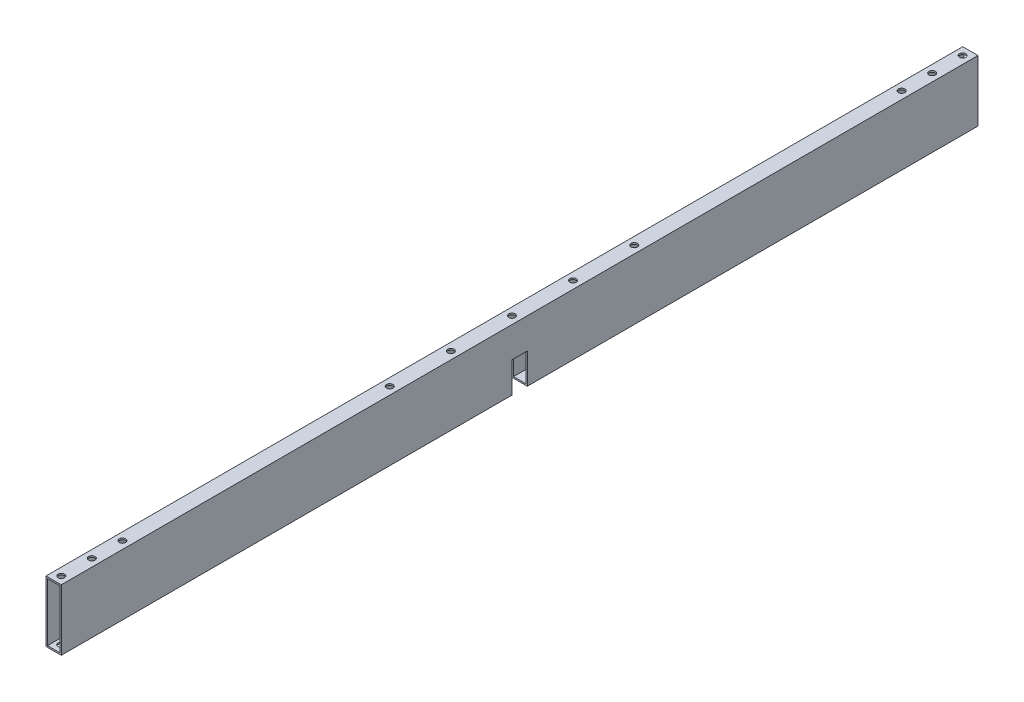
ISO-10303-21;
HEADER;
FILE_DESCRIPTION(('STEP AP214'),'2;1');
FILE_NAME('part.step','',(''),(''),'','','');
FILE_SCHEMA(('AUTOMOTIVE_DESIGN { 1 0 10303 214 1 1 1 1 }'));
ENDSEC;
DATA;
#1=APPLICATION_CONTEXT('core data for automotive mechanical design processes');
#2=APPLICATION_PROTOCOL_DEFINITION('international standard','automotive_design',2000,#1);
#3=PRODUCT_CONTEXT('',#1,'mechanical');
#4=PRODUCT('Part','Part','',(#3));
#5=PRODUCT_RELATED_PRODUCT_CATEGORY('part','',(#4));
#6=PRODUCT_DEFINITION_FORMATION('','',#4);
#7=PRODUCT_DEFINITION_CONTEXT('part definition',#1,'design');
#8=PRODUCT_DEFINITION('design','',#6,#7);
#9=PRODUCT_DEFINITION_SHAPE('','',#8);
#10=(LENGTH_UNIT() NAMED_UNIT(*) SI_UNIT(.MILLI.,.METRE.));
#11=(NAMED_UNIT(*) PLANE_ANGLE_UNIT() SI_UNIT($,.RADIAN.));
#12=(NAMED_UNIT(*) SI_UNIT($,.STERADIAN.) SOLID_ANGLE_UNIT());
#13=UNCERTAINTY_MEASURE_WITH_UNIT(LENGTH_MEASURE(1.E-05),#10,'distance_accuracy_value','');
#14=(GEOMETRIC_REPRESENTATION_CONTEXT(3) GLOBAL_UNCERTAINTY_ASSIGNED_CONTEXT((#13)) GLOBAL_UNIT_ASSIGNED_CONTEXT((#10,
#11,#12)) REPRESENTATION_CONTEXT('',''));
#15=CARTESIAN_POINT('',(0.,0.,0.));
#16=DIRECTION('',(0.,0.,1.));
#17=DIRECTION('',(1.,0.,0.));
#18=AXIS2_PLACEMENT_3D('',#15,#16,#17);
#19=CARTESIAN_POINT('',(-5.,-20.,300.));
#20=DIRECTION('',(0.,1.,0.));
#21=DIRECTION('',(0.,0.,1.));
#22=AXIS2_PLACEMENT_3D('',#19,#20,#21);
#23=PLANE('',#22);
#24=CARTESIAN_POINT('',(2.74086309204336E-13,-20.,80.));
#25=DIRECTION('',(0.,1.,0.));
#26=DIRECTION('',(0.,0.,1.));
#27=AXIS2_PLACEMENT_3D('',#24,#25,#26);
#28=CIRCLE('',#27,2.1);
#29=CARTESIAN_POINT('',(2.74086309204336E-13,-20.,82.1));
#30=VERTEX_POINT('',#29);
#31=EDGE_CURVE('E225',#30,#30,#28,.T.);
#32=ORIENTED_EDGE('',*,*,#31,.T.);
#33=EDGE_LOOP('',(#32));
#34=FACE_BOUND('',#33,.T.);
#35=CARTESIAN_POINT('',(1.37043154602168E-13,-20.,40.));
#36=DIRECTION('',(0.,1.,0.));
#37=DIRECTION('',(0.,0.,1.));
#38=AXIS2_PLACEMENT_3D('',#35,#36,#37);
#39=CIRCLE('',#38,2.1);
#40=CARTESIAN_POINT('',(1.37043154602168E-13,-20.,42.1));
#41=VERTEX_POINT('',#40);
#42=EDGE_CURVE('E758',#41,#41,#39,.T.);
#43=ORIENTED_EDGE('',*,*,#42,.T.);
#44=EDGE_LOOP('',(#43));
#45=FACE_BOUND('',#44,.T.);
#46=CARTESIAN_POINT('',(0.,-20.,295.));
#47=DIRECTION('',(0.,-1.,0.));
#48=DIRECTION('',(0.,0.,-1.));
#49=AXIS2_PLACEMENT_3D('',#46,#47,#48);
#50=CIRCLE('',#49,2.1);
#51=CARTESIAN_POINT('',(0.,-20.,292.9));
#52=VERTEX_POINT('',#51);
#53=EDGE_CURVE('E212',#52,#52,#50,.T.);
#54=ORIENTED_EDGE('',*,*,#53,.F.);
#55=EDGE_LOOP('',(#54));
#56=FACE_BOUND('',#55,.T.);
#57=CARTESIAN_POINT('',(2.0818924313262E-13,-20.,275.));
#58=DIRECTION('',(0.,-1.,0.));
#59=DIRECTION('',(0.,0.,-1.));
#60=AXIS2_PLACEMENT_3D('',#57,#58,#59);
#61=CIRCLE('',#60,2.1);
#62=CARTESIAN_POINT('',(2.0818924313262E-13,-20.,272.9));
#63=VERTEX_POINT('',#62);
#64=EDGE_CURVE('E254',#63,#63,#61,.T.);
#65=ORIENTED_EDGE('',*,*,#64,.F.);
#66=EDGE_LOOP('',(#65));
#67=FACE_BOUND('',#66,.T.);
#68=CARTESIAN_POINT('',(4.16453476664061E-13,-20.,255.));
#69=DIRECTION('',(0.,-1.,0.));
#70=DIRECTION('',(0.,0.,-1.));
#71=AXIS2_PLACEMENT_3D('',#68,#69,#70);
#72=CIRCLE('',#71,2.1);
#73=CARTESIAN_POINT('',(4.16453476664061E-13,-20.,252.9));
#74=VERTEX_POINT('',#73);
#75=EDGE_CURVE('E260',#74,#74,#72,.T.);
#76=ORIENTED_EDGE('',*,*,#75,.F.);
#77=EDGE_LOOP('',(#76));
#78=FACE_BOUND('',#77,.T.);
#79=DIRECTION('',(0.,0.,-1.));
#80=VECTOR('',#79,1.);
#81=CARTESIAN_POINT('',(-5.,-20.,300.));
#82=LINE('',#81,#80);
#83=CARTESIAN_POINT('',(-5.,-20.,300.));
#84=VERTEX_POINT('',#83);
#85=CARTESIAN_POINT('',(-5.,-20.,5.));
#86=VERTEX_POINT('',#85);
#87=EDGE_CURVE('E174',#84,#86,#82,.T.);
#88=ORIENTED_EDGE('',*,*,#87,.T.);
#89=DIRECTION('',(1.,0.,0.));
#90=VECTOR('',#89,1.);
#91=CARTESIAN_POINT('',(-5.,-20.,5.));
#92=LINE('',#91,#90);
#93=CARTESIAN_POINT('',(5.,-20.,5.));
#94=VERTEX_POINT('',#93);
#95=EDGE_CURVE('E155',#86,#94,#92,.T.);
#96=ORIENTED_EDGE('',*,*,#95,.T.);
#97=DIRECTION('',(0.,0.,-1.));
#98=VECTOR('',#97,1.);
#99=CARTESIAN_POINT('',(5.,-20.,300.));
#100=LINE('',#99,#98);
#101=CARTESIAN_POINT('',(5.,-20.,300.));
#102=VERTEX_POINT('',#101);
#103=EDGE_CURVE('E186',#102,#94,#100,.T.);
#104=ORIENTED_EDGE('',*,*,#103,.F.);
#105=DIRECTION('',(1.,0.,0.));
#106=VECTOR('',#105,1.);
#107=CARTESIAN_POINT('',(-5.,-20.,300.));
#108=LINE('',#107,#106);
#109=EDGE_CURVE('E179',#84,#102,#108,.T.);
#110=ORIENTED_EDGE('',*,*,#109,.F.);
#111=EDGE_LOOP('',(#88,#96,#104,#110));
#112=FACE_BOUND('',#111,.T.);
#113=ADVANCED_FACE('F41',(#34,#45,#56,#67,#78,#112),#23,.F.);
#114=CARTESIAN_POINT('',(-4.00000000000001,-19.,300.));
#115=DIRECTION('',(0.,1.,0.));
#116=DIRECTION('',(0.,0.,1.));
#117=AXIS2_PLACEMENT_3D('',#114,#115,#116);
#118=PLANE('',#117);
#119=CARTESIAN_POINT('',(2.74086309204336E-13,-19.,80.));
#120=DIRECTION('',(0.,1.,0.));
#121=DIRECTION('',(0.,0.,1.));
#122=AXIS2_PLACEMENT_3D('',#119,#120,#121);
#123=CIRCLE('',#122,2.1);
#124=CARTESIAN_POINT('',(2.74086309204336E-13,-19.,82.1));
#125=VERTEX_POINT('',#124);
#126=EDGE_CURVE('E242',#125,#125,#123,.T.);
#127=ORIENTED_EDGE('',*,*,#126,.F.);
#128=EDGE_LOOP('',(#127));
#129=FACE_BOUND('',#128,.T.);
#130=CARTESIAN_POINT('',(1.37043154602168E-13,-19.,40.));
#131=DIRECTION('',(0.,1.,0.));
#132=DIRECTION('',(0.,0.,1.));
#133=AXIS2_PLACEMENT_3D('',#130,#131,#132);
#134=CIRCLE('',#133,2.1);
#135=CARTESIAN_POINT('',(1.37043154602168E-13,-19.,42.1));
#136=VERTEX_POINT('',#135);
#137=EDGE_CURVE('E234',#136,#136,#134,.T.);
#138=ORIENTED_EDGE('',*,*,#137,.F.);
#139=EDGE_LOOP('',(#138));
#140=FACE_BOUND('',#139,.T.);
#141=CARTESIAN_POINT('',(0.,-19.,295.));
#142=DIRECTION('',(0.,1.,0.));
#143=DIRECTION('',(0.,0.,1.));
#144=AXIS2_PLACEMENT_3D('',#141,#142,#143);
#145=CIRCLE('',#144,2.1);
#146=CARTESIAN_POINT('',(0.,-19.,297.1));
#147=VERTEX_POINT('',#146);
#148=EDGE_CURVE('E220',#147,#147,#145,.F.);
#149=ORIENTED_EDGE('',*,*,#148,.T.);
#150=EDGE_LOOP('',(#149));
#151=FACE_BOUND('',#150,.T.);
#152=CARTESIAN_POINT('',(2.0818924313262E-13,-19.,275.));
#153=DIRECTION('',(0.,1.,0.));
#154=DIRECTION('',(0.,0.,1.));
#155=AXIS2_PLACEMENT_3D('',#152,#153,#154);
#156=CIRCLE('',#155,2.1);
#157=CARTESIAN_POINT('',(2.0818924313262E-13,-19.,277.1));
#158=VERTEX_POINT('',#157);
#159=EDGE_CURVE('E216',#158,#158,#156,.F.);
#160=ORIENTED_EDGE('',*,*,#159,.T.);
#161=EDGE_LOOP('',(#160));
#162=FACE_BOUND('',#161,.T.);
#163=CARTESIAN_POINT('',(4.16453476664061E-13,-19.,255.));
#164=DIRECTION('',(0.,1.,0.));
#165=DIRECTION('',(0.,0.,1.));
#166=AXIS2_PLACEMENT_3D('',#163,#164,#165);
#167=CIRCLE('',#166,2.1);
#168=CARTESIAN_POINT('',(4.16453476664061E-13,-19.,257.1));
#169=VERTEX_POINT('',#168);
#170=EDGE_CURVE('E211',#169,#169,#167,.F.);
#171=ORIENTED_EDGE('',*,*,#170,.T.);
#172=EDGE_LOOP('',(#171));
#173=FACE_BOUND('',#172,.T.);
#174=DIRECTION('',(1.,0.,0.));
#175=VECTOR('',#174,1.);
#176=CARTESIAN_POINT('',(-4.00000000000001,-19.,5.));
#177=LINE('',#176,#175);
#178=CARTESIAN_POINT('',(-4.00000000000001,-19.,5.));
#179=VERTEX_POINT('',#178);
#180=CARTESIAN_POINT('',(4.,-19.,5.));
#181=VERTEX_POINT('',#180);
#182=EDGE_CURVE('E50',#179,#181,#177,.T.);
#183=ORIENTED_EDGE('',*,*,#182,.F.);
#184=DIRECTION('',(0.,0.,-1.));
#185=VECTOR('',#184,1.);
#186=CARTESIAN_POINT('',(-4.00000000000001,-19.,300.));
#187=LINE('',#186,#185);
#188=CARTESIAN_POINT('',(-4.00000000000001,-19.,300.));
#189=VERTEX_POINT('',#188);
#190=EDGE_CURVE('E345',#189,#179,#187,.T.);
#191=ORIENTED_EDGE('',*,*,#190,.F.);
#192=DIRECTION('',(1.,0.,0.));
#193=VECTOR('',#192,1.);
#194=CARTESIAN_POINT('',(-4.00000000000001,-19.,300.));
#195=LINE('',#194,#193);
#196=CARTESIAN_POINT('',(4.,-19.,300.));
#197=VERTEX_POINT('',#196);
#198=EDGE_CURVE('E328',#189,#197,#195,.T.);
#199=ORIENTED_EDGE('',*,*,#198,.T.);
#200=DIRECTION('',(0.,0.,-1.));
#201=VECTOR('',#200,1.);
#202=CARTESIAN_POINT('',(4.,-19.,300.));
#203=LINE('',#202,#201);
#204=EDGE_CURVE('E341',#197,#181,#203,.T.);
#205=ORIENTED_EDGE('',*,*,#204,.T.);
#206=EDGE_LOOP('',(#183,#191,#199,#205));
#207=FACE_BOUND('',#206,.T.);
#208=ADVANCED_FACE('F404',(#129,#140,#151,#162,#173,#207),#118,.T.);
#209=CARTESIAN_POINT('',(0.,0.,300.));
#210=DIRECTION('',(0.,0.,-1.));
#211=DIRECTION('',(-1.,0.,0.));
#212=AXIS2_PLACEMENT_3D('',#209,#210,#211);
#213=PLANE('',#212);
#214=DIRECTION('',(0.,1.,0.));
#215=VECTOR('',#214,1.);
#216=CARTESIAN_POINT('',(5.,-20.,300.));
#217=LINE('',#216,#215);
#218=CARTESIAN_POINT('',(5.,20.,300.));
#219=VERTEX_POINT('',#218);
#220=EDGE_CURVE('E354',#102,#219,#217,.T.);
#221=ORIENTED_EDGE('',*,*,#220,.T.);
#222=DIRECTION('',(-1.,0.,0.));
#223=VECTOR('',#222,1.);
#224=CARTESIAN_POINT('',(-5.,20.,300.));
#225=LINE('',#224,#223);
#226=CARTESIAN_POINT('',(-5.,20.,300.));
#227=VERTEX_POINT('',#226);
#228=EDGE_CURVE('E357',#219,#227,#225,.T.);
#229=ORIENTED_EDGE('',*,*,#228,.T.);
#230=DIRECTION('',(0.,-1.,0.));
#231=VECTOR('',#230,1.);
#232=CARTESIAN_POINT('',(-5.,-20.,300.));
#233=LINE('',#232,#231);
#234=EDGE_CURVE('E360',#227,#84,#233,.T.);
#235=ORIENTED_EDGE('',*,*,#234,.T.);
#236=ORIENTED_EDGE('',*,*,#109,.T.);
#237=EDGE_LOOP('',(#221,#229,#235,#236));
#238=FACE_BOUND('',#237,.T.);
#239=DIRECTION('',(0.,1.,0.));
#240=VECTOR('',#239,1.);
#241=CARTESIAN_POINT('',(4.,-19.,300.));
#242=LINE('',#241,#240);
#243=CARTESIAN_POINT('',(4.,19.,300.));
#244=VERTEX_POINT('',#243);
#245=EDGE_CURVE('E320',#197,#244,#242,.T.);
#246=ORIENTED_EDGE('',*,*,#245,.F.);
#247=ORIENTED_EDGE('',*,*,#198,.F.);
#248=DIRECTION('',(0.,-1.,0.));
#249=VECTOR('',#248,1.);
#250=CARTESIAN_POINT('',(-4.00000000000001,-19.,300.));
#251=LINE('',#250,#249);
#252=CARTESIAN_POINT('',(-4.00000000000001,19.,300.));
#253=VERTEX_POINT('',#252);
#254=EDGE_CURVE('E325',#253,#189,#251,.T.);
#255=ORIENTED_EDGE('',*,*,#254,.F.);
#256=DIRECTION('',(-1.,0.,0.));
#257=VECTOR('',#256,1.);
#258=CARTESIAN_POINT('',(-4.00000000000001,19.,300.));
#259=LINE('',#258,#257);
#260=EDGE_CURVE('E322',#244,#253,#259,.T.);
#261=ORIENTED_EDGE('',*,*,#260,.F.);
#262=EDGE_LOOP('',(#246,#247,#255,#261));
#263=FACE_BOUND('',#262,.T.);
#264=ADVANCED_FACE('F387',(#238,#263),#213,.F.);
#265=CARTESIAN_POINT('',(0.,0.,-300.));
#266=DIRECTION('',(0.,0.,-1.));
#267=DIRECTION('',(-1.,0.,0.));
#268=AXIS2_PLACEMENT_3D('',#265,#266,#267);
#269=PLANE('',#268);
#270=DIRECTION('',(0.,1.,0.));
#271=VECTOR('',#270,1.);
#272=CARTESIAN_POINT('',(5.,-20.,-300.));
#273=LINE('',#272,#271);
#274=CARTESIAN_POINT('',(5.,-20.,-300.));
#275=VERTEX_POINT('',#274);
#276=CARTESIAN_POINT('',(5.,20.,-300.));
#277=VERTEX_POINT('',#276);
#278=EDGE_CURVE('E353',#275,#277,#273,.T.);
#279=ORIENTED_EDGE('',*,*,#278,.F.);
#280=DIRECTION('',(1.,0.,0.));
#281=VECTOR('',#280,1.);
#282=CARTESIAN_POINT('',(-5.,-20.,-300.));
#283=LINE('',#282,#281);
#284=CARTESIAN_POINT('',(-5.,-20.,-300.));
#285=VERTEX_POINT('',#284);
#286=EDGE_CURVE('E358',#285,#275,#283,.T.);
#287=ORIENTED_EDGE('',*,*,#286,.F.);
#288=DIRECTION('',(0.,-1.,0.));
#289=VECTOR('',#288,1.);
#290=CARTESIAN_POINT('',(-5.,-20.,-300.));
#291=LINE('',#290,#289);
#292=CARTESIAN_POINT('',(-5.,20.,-300.));
#293=VERTEX_POINT('',#292);
#294=EDGE_CURVE('E368',#293,#285,#291,.T.);
#295=ORIENTED_EDGE('',*,*,#294,.F.);
#296=DIRECTION('',(-1.,0.,0.));
#297=VECTOR('',#296,1.);
#298=CARTESIAN_POINT('',(-5.,20.,-300.));
#299=LINE('',#298,#297);
#300=EDGE_CURVE('E366',#277,#293,#299,.T.);
#301=ORIENTED_EDGE('',*,*,#300,.F.);
#302=EDGE_LOOP('',(#279,#287,#295,#301));
#303=FACE_BOUND('',#302,.T.);
#304=DIRECTION('',(1.,0.,0.));
#305=VECTOR('',#304,1.);
#306=CARTESIAN_POINT('',(-4.00000000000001,-19.,-300.));
#307=LINE('',#306,#305);
#308=CARTESIAN_POINT('',(-4.00000000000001,-19.,-300.));
#309=VERTEX_POINT('',#308);
#310=CARTESIAN_POINT('',(4.,-19.,-300.));
#311=VERTEX_POINT('',#310);
#312=EDGE_CURVE('E323',#309,#311,#307,.T.);
#313=ORIENTED_EDGE('',*,*,#312,.T.);
#314=DIRECTION('',(0.,1.,0.));
#315=VECTOR('',#314,1.);
#316=CARTESIAN_POINT('',(4.,-19.,-300.));
#317=LINE('',#316,#315);
#318=CARTESIAN_POINT('',(4.,19.,-300.));
#319=VERTEX_POINT('',#318);
#320=EDGE_CURVE('E319',#311,#319,#317,.T.);
#321=ORIENTED_EDGE('',*,*,#320,.T.);
#322=DIRECTION('',(-1.,0.,0.));
#323=VECTOR('',#322,1.);
#324=CARTESIAN_POINT('',(-4.00000000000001,19.,-300.));
#325=LINE('',#324,#323);
#326=CARTESIAN_POINT('',(-4.00000000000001,19.,-300.));
#327=VERTEX_POINT('',#326);
#328=EDGE_CURVE('E333',#319,#327,#325,.T.);
#329=ORIENTED_EDGE('',*,*,#328,.T.);
#330=DIRECTION('',(0.,-1.,0.));
#331=VECTOR('',#330,1.);
#332=CARTESIAN_POINT('',(-4.00000000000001,-19.,-300.));
#333=LINE('',#332,#331);
#334=EDGE_CURVE('E336',#327,#309,#333,.T.);
#335=ORIENTED_EDGE('',*,*,#334,.T.);
#336=EDGE_LOOP('',(#313,#321,#329,#335));
#337=FACE_BOUND('',#336,.T.);
#338=ADVANCED_FACE('F379',(#303,#337),#269,.T.);
#339=CARTESIAN_POINT('',(5.,-20.,300.));
#340=DIRECTION('',(-1.,0.,0.));
#341=DIRECTION('',(0.,0.,1.));
#342=AXIS2_PLACEMENT_3D('',#339,#340,#341);
#343=PLANE('',#342);
#344=ORIENTED_EDGE('',*,*,#103,.T.);
#345=DIRECTION('',(0.,-1.,0.));
#346=VECTOR('',#345,1.);
#347=CARTESIAN_POINT('',(5.,-20.,5.));
#348=LINE('',#347,#346);
#349=CARTESIAN_POINT('',(5.,0.,5.));
#350=VERTEX_POINT('',#349);
#351=EDGE_CURVE('E162',#350,#94,#348,.T.);
#352=ORIENTED_EDGE('',*,*,#351,.F.);
#353=DIRECTION('',(0.,0.,1.));
#354=VECTOR('',#353,1.);
#355=CARTESIAN_POINT('',(5.,0.,5.));
#356=LINE('',#355,#354);
#357=CARTESIAN_POINT('',(5.,0.,-5.));
#358=VERTEX_POINT('',#357);
#359=EDGE_CURVE('E177',#358,#350,#356,.T.);
#360=ORIENTED_EDGE('',*,*,#359,.F.);
#361=DIRECTION('',(0.,1.,0.));
#362=VECTOR('',#361,1.);
#363=CARTESIAN_POINT('',(5.,-20.,-5.));
#364=LINE('',#363,#362);
#365=CARTESIAN_POINT('',(5.,-20.,-5.));
#366=VERTEX_POINT('',#365);
#367=EDGE_CURVE('E274',#366,#358,#364,.T.);
#368=ORIENTED_EDGE('',*,*,#367,.F.);
#369=EDGE_CURVE('E363',#366,#275,#100,.T.);
#370=ORIENTED_EDGE('',*,*,#369,.T.);
#371=ORIENTED_EDGE('',*,*,#278,.T.);
#372=DIRECTION('',(0.,0.,-1.));
#373=VECTOR('',#372,1.);
#374=CARTESIAN_POINT('',(5.,20.,300.));
#375=LINE('',#374,#373);
#376=EDGE_CURVE('E184',#219,#277,#375,.T.);
#377=ORIENTED_EDGE('',*,*,#376,.F.);
#378=ORIENTED_EDGE('',*,*,#220,.F.);
#379=EDGE_LOOP('',(#344,#352,#360,#368,#370,#371,#377,#378));
#380=FACE_BOUND('',#379,.T.);
#381=ADVANCED_FACE('F43',(#380),#343,.F.);
#382=CARTESIAN_POINT('',(-5.,20.,300.));
#383=DIRECTION('',(0.,-1.,0.));
#384=DIRECTION('',(0.,0.,-1.));
#385=AXIS2_PLACEMENT_3D('',#382,#383,#384);
#386=PLANE('',#385);
#387=CARTESIAN_POINT('',(2.74086309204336E-13,20.,80.));
#388=DIRECTION('',(0.,1.,0.));
#389=DIRECTION('',(0.,0.,1.));
#390=AXIS2_PLACEMENT_3D('',#387,#388,#389);
#391=CIRCLE('',#390,2.1);
#392=CARTESIAN_POINT('',(2.74086309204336E-13,20.,82.1));
#393=VERTEX_POINT('',#392);
#394=EDGE_CURVE('E750',#393,#393,#391,.T.);
#395=ORIENTED_EDGE('',*,*,#394,.F.);
#396=EDGE_LOOP('',(#395));
#397=FACE_BOUND('',#396,.T.);
#398=CARTESIAN_POINT('',(1.37043154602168E-13,20.,40.));
#399=DIRECTION('',(0.,1.,0.));
#400=DIRECTION('',(0.,0.,1.));
#401=AXIS2_PLACEMENT_3D('',#398,#399,#400);
#402=CIRCLE('',#401,2.1);
#403=CARTESIAN_POINT('',(1.37043154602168E-13,20.,42.1));
#404=VERTEX_POINT('',#403);
#405=EDGE_CURVE('E753',#404,#404,#402,.T.);
#406=ORIENTED_EDGE('',*,*,#405,.F.);
#407=EDGE_LOOP('',(#406));
#408=FACE_BOUND('',#407,.T.);
#409=CARTESIAN_POINT('',(0.,20.,0.));
#410=DIRECTION('',(0.,1.,0.));
#411=DIRECTION('',(0.,0.,1.));
#412=AXIS2_PLACEMENT_3D('',#409,#410,#411);
#413=CIRCLE('',#412,2.1);
#414=CARTESIAN_POINT('',(0.,20.,2.1));
#415=VERTEX_POINT('',#414);
#416=EDGE_CURVE('E761',#415,#415,#413,.T.);
#417=ORIENTED_EDGE('',*,*,#416,.F.);
#418=EDGE_LOOP('',(#417));
#419=FACE_BOUND('',#418,.T.);
#420=CARTESIAN_POINT('',(-1.37910516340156E-13,20.,-40.));
#421=DIRECTION('',(0.,1.,0.));
#422=DIRECTION('',(0.,0.,1.));
#423=AXIS2_PLACEMENT_3D('',#420,#421,#422);
#424=CIRCLE('',#423,2.1);
#425=CARTESIAN_POINT('',(-1.37910516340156E-13,20.,-37.9));
#426=VERTEX_POINT('',#425);
#427=EDGE_CURVE('E764',#426,#426,#424,.T.);
#428=ORIENTED_EDGE('',*,*,#427,.F.);
#429=EDGE_LOOP('',(#428));
#430=FACE_BOUND('',#429,.T.);
#431=CARTESIAN_POINT('',(-2.74953670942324E-13,20.,-80.));
#432=DIRECTION('',(0.,1.,0.));
#433=DIRECTION('',(0.,0.,1.));
#434=AXIS2_PLACEMENT_3D('',#431,#432,#433);
#435=CIRCLE('',#434,2.1);
#436=CARTESIAN_POINT('',(-2.74953670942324E-13,20.,-77.9));
#437=VERTEX_POINT('',#436);
#438=EDGE_CURVE('E768',#437,#437,#435,.T.);
#439=ORIENTED_EDGE('',*,*,#438,.F.);
#440=EDGE_LOOP('',(#439));
#441=FACE_BOUND('',#440,.T.);
#442=CARTESIAN_POINT('',(0.,20.,295.));
#443=DIRECTION('',(0.,-1.,0.));
#444=DIRECTION('',(0.,0.,-1.));
#445=AXIS2_PLACEMENT_3D('',#442,#443,#444);
#446=CIRCLE('',#445,2.1);
#447=CARTESIAN_POINT('',(0.,20.,292.9));
#448=VERTEX_POINT('',#447);
#449=EDGE_CURVE('E251',#448,#448,#446,.T.);
#450=ORIENTED_EDGE('',*,*,#449,.T.);
#451=EDGE_LOOP('',(#450));
#452=FACE_BOUND('',#451,.T.);
#453=CARTESIAN_POINT('',(2.0818924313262E-13,20.,275.));
#454=DIRECTION('',(0.,-1.,0.));
#455=DIRECTION('',(0.,0.,-1.));
#456=AXIS2_PLACEMENT_3D('',#453,#454,#455);
#457=CIRCLE('',#456,2.1);
#458=CARTESIAN_POINT('',(2.0818924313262E-13,20.,272.9));
#459=VERTEX_POINT('',#458);
#460=EDGE_CURVE('E257',#459,#459,#457,.T.);
#461=ORIENTED_EDGE('',*,*,#460,.T.);
#462=EDGE_LOOP('',(#461));
#463=FACE_BOUND('',#462,.T.);
#464=CARTESIAN_POINT('',(4.16453476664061E-13,20.,255.));
#465=DIRECTION('',(0.,-1.,0.));
#466=DIRECTION('',(0.,0.,-1.));
#467=AXIS2_PLACEMENT_3D('',#464,#465,#466);
#468=CIRCLE('',#467,2.1);
#469=CARTESIAN_POINT('',(4.16453476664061E-13,20.,252.9));
#470=VERTEX_POINT('',#469);
#471=EDGE_CURVE('E248',#470,#470,#468,.T.);
#472=ORIENTED_EDGE('',*,*,#471,.T.);
#473=EDGE_LOOP('',(#472));
#474=FACE_BOUND('',#473,.T.);
#475=CARTESIAN_POINT('',(0.,20.,-295.));
#476=DIRECTION('',(0.,1.,0.));
#477=DIRECTION('',(0.,0.,1.));
#478=AXIS2_PLACEMENT_3D('',#475,#476,#477);
#479=CIRCLE('',#478,2.1);
#480=CARTESIAN_POINT('',(0.,20.,-292.9));
#481=VERTEX_POINT('',#480);
#482=EDGE_CURVE('E299',#481,#481,#479,.T.);
#483=ORIENTED_EDGE('',*,*,#482,.F.);
#484=EDGE_LOOP('',(#483));
#485=FACE_BOUND('',#484,.T.);
#486=CARTESIAN_POINT('',(2.0818924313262E-13,20.,-275.));
#487=DIRECTION('',(0.,1.,0.));
#488=DIRECTION('',(0.,0.,1.));
#489=AXIS2_PLACEMENT_3D('',#486,#487,#488);
#490=CIRCLE('',#489,2.1);
#491=CARTESIAN_POINT('',(2.0818924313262E-13,20.,-272.9));
#492=VERTEX_POINT('',#491);
#493=EDGE_CURVE('E302',#492,#492,#490,.T.);
#494=ORIENTED_EDGE('',*,*,#493,.F.);
#495=EDGE_LOOP('',(#494));
#496=FACE_BOUND('',#495,.T.);
#497=CARTESIAN_POINT('',(4.16453476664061E-13,20.,-255.));
#498=DIRECTION('',(0.,1.,0.));
#499=DIRECTION('',(0.,0.,1.));
#500=AXIS2_PLACEMENT_3D('',#497,#498,#499);
#501=CIRCLE('',#500,2.1);
#502=CARTESIAN_POINT('',(4.16453476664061E-13,20.,-252.9));
#503=VERTEX_POINT('',#502);
#504=EDGE_CURVE('E308',#503,#503,#501,.T.);
#505=ORIENTED_EDGE('',*,*,#504,.F.);
#506=EDGE_LOOP('',(#505));
#507=FACE_BOUND('',#506,.T.);
#508=ORIENTED_EDGE('',*,*,#300,.T.);
#509=DIRECTION('',(0.,0.,-1.));
#510=VECTOR('',#509,1.);
#511=CARTESIAN_POINT('',(-5.,20.,300.));
#512=LINE('',#511,#510);
#513=EDGE_CURVE('E180',#227,#293,#512,.T.);
#514=ORIENTED_EDGE('',*,*,#513,.F.);
#515=ORIENTED_EDGE('',*,*,#228,.F.);
#516=ORIENTED_EDGE('',*,*,#376,.T.);
#517=EDGE_LOOP('',(#508,#514,#515,#516));
#518=FACE_BOUND('',#517,.T.);
#519=ADVANCED_FACE('F391',(#397,#408,#419,#430,#441,#452,#463,#474,#485,#496,#507,#518),#386,.F.);
#520=CARTESIAN_POINT('',(-5.,-20.,300.));
#521=DIRECTION('',(1.,0.,0.));
#522=DIRECTION('',(0.,0.,-1.));
#523=AXIS2_PLACEMENT_3D('',#520,#521,#522);
#524=PLANE('',#523);
#525=DIRECTION('',(0.,0.,1.));
#526=VECTOR('',#525,1.);
#527=CARTESIAN_POINT('',(-5.,0.,5.));
#528=LINE('',#527,#526);
#529=CARTESIAN_POINT('',(-5.,0.,-5.));
#530=VERTEX_POINT('',#529);
#531=CARTESIAN_POINT('',(-5.,0.,5.));
#532=VERTEX_POINT('',#531);
#533=EDGE_CURVE('E168',#530,#532,#528,.T.);
#534=ORIENTED_EDGE('',*,*,#533,.T.);
#535=DIRECTION('',(0.,-1.,0.));
#536=VECTOR('',#535,1.);
#537=CARTESIAN_POINT('',(-5.,-20.,5.));
#538=LINE('',#537,#536);
#539=EDGE_CURVE('E159',#532,#86,#538,.T.);
#540=ORIENTED_EDGE('',*,*,#539,.T.);
#541=ORIENTED_EDGE('',*,*,#87,.F.);
#542=ORIENTED_EDGE('',*,*,#234,.F.);
#543=ORIENTED_EDGE('',*,*,#513,.T.);
#544=ORIENTED_EDGE('',*,*,#294,.T.);
#545=CARTESIAN_POINT('',(-5.,-20.,-5.));
#546=VERTEX_POINT('',#545);
#547=EDGE_CURVE('E181',#546,#285,#82,.T.);
#548=ORIENTED_EDGE('',*,*,#547,.F.);
#549=DIRECTION('',(0.,1.,0.));
#550=VECTOR('',#549,1.);
#551=CARTESIAN_POINT('',(-5.,-20.,-5.));
#552=LINE('',#551,#550);
#553=EDGE_CURVE('E58',#546,#530,#552,.T.);
#554=ORIENTED_EDGE('',*,*,#553,.T.);
#555=EDGE_LOOP('',(#534,#540,#541,#542,#543,#544,#548,#554));
#556=FACE_BOUND('',#555,.T.);
#557=ADVANCED_FACE('F172',(#556),#524,.F.);
#558=CARTESIAN_POINT('',(-1.37910516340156E-13,-20.,-40.));
#559=DIRECTION('',(0.,1.,0.));
#560=DIRECTION('',(0.,0.,1.));
#561=AXIS2_PLACEMENT_3D('',#558,#559,#560);
#562=CIRCLE('',#561,2.1);
#563=CARTESIAN_POINT('',(-1.37910516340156E-13,-20.,-37.9));
#564=VERTEX_POINT('',#563);
#565=EDGE_CURVE('E428',#564,#564,#562,.T.);
#566=ORIENTED_EDGE('',*,*,#565,.T.);
#567=EDGE_LOOP('',(#566));
#568=FACE_BOUND('',#567,.T.);
#569=CARTESIAN_POINT('',(-2.74953670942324E-13,-20.,-80.));
#570=DIRECTION('',(0.,1.,0.));
#571=DIRECTION('',(0.,0.,1.));
#572=AXIS2_PLACEMENT_3D('',#569,#570,#571);
#573=CIRCLE('',#572,2.1);
#574=CARTESIAN_POINT('',(-2.74953670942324E-13,-20.,-77.9));
#575=VERTEX_POINT('',#574);
#576=EDGE_CURVE('E432',#575,#575,#573,.T.);
#577=ORIENTED_EDGE('',*,*,#576,.T.);
#578=EDGE_LOOP('',(#577));
#579=FACE_BOUND('',#578,.T.);
#580=CARTESIAN_POINT('',(0.,-20.,-295.));
#581=DIRECTION('',(0.,1.,0.));
#582=DIRECTION('',(0.,0.,1.));
#583=AXIS2_PLACEMENT_3D('',#580,#581,#582);
#584=CIRCLE('',#583,2.1);
#585=CARTESIAN_POINT('',(0.,-20.,-292.9));
#586=VERTEX_POINT('',#585);
#587=EDGE_CURVE('E197',#586,#586,#584,.T.);
#588=ORIENTED_EDGE('',*,*,#587,.T.);
#589=EDGE_LOOP('',(#588));
#590=FACE_BOUND('',#589,.T.);
#591=CARTESIAN_POINT('',(2.0818924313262E-13,-20.,-275.));
#592=DIRECTION('',(0.,1.,0.));
#593=DIRECTION('',(0.,0.,1.));
#594=AXIS2_PLACEMENT_3D('',#591,#592,#593);
#595=CIRCLE('',#594,2.1);
#596=CARTESIAN_POINT('',(2.0818924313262E-13,-20.,-272.9));
#597=VERTEX_POINT('',#596);
#598=EDGE_CURVE('E305',#597,#597,#595,.T.);
#599=ORIENTED_EDGE('',*,*,#598,.T.);
#600=EDGE_LOOP('',(#599));
#601=FACE_BOUND('',#600,.T.);
#602=CARTESIAN_POINT('',(4.16453476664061E-13,-20.,-255.));
#603=DIRECTION('',(0.,1.,0.));
#604=DIRECTION('',(0.,0.,1.));
#605=AXIS2_PLACEMENT_3D('',#602,#603,#604);
#606=CIRCLE('',#605,2.1);
#607=CARTESIAN_POINT('',(4.16453476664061E-13,-20.,-252.9));
#608=VERTEX_POINT('',#607);
#609=EDGE_CURVE('E296',#608,#608,#606,.T.);
#610=ORIENTED_EDGE('',*,*,#609,.T.);
#611=EDGE_LOOP('',(#610));
#612=FACE_BOUND('',#611,.T.);
#613=ORIENTED_EDGE('',*,*,#369,.F.);
#614=DIRECTION('',(1.,0.,0.));
#615=VECTOR('',#614,1.);
#616=CARTESIAN_POINT('',(-5.,-20.,-5.));
#617=LINE('',#616,#615);
#618=EDGE_CURVE('E167',#546,#366,#617,.T.);
#619=ORIENTED_EDGE('',*,*,#618,.F.);
#620=ORIENTED_EDGE('',*,*,#547,.T.);
#621=ORIENTED_EDGE('',*,*,#286,.T.);
#622=EDGE_LOOP('',(#613,#619,#620,#621));
#623=FACE_BOUND('',#622,.T.);
#624=ADVANCED_FACE('F375',(#568,#579,#590,#601,#612,#623),#23,.F.);
#625=CARTESIAN_POINT('',(4.,-19.,300.));
#626=DIRECTION('',(-1.,0.,0.));
#627=DIRECTION('',(0.,0.,1.));
#628=AXIS2_PLACEMENT_3D('',#625,#626,#627);
#629=PLANE('',#628);
#630=DIRECTION('',(0.,1.,0.));
#631=VECTOR('',#630,1.);
#632=CARTESIAN_POINT('',(4.,-19.,5.));
#633=LINE('',#632,#631);
#634=CARTESIAN_POINT('',(4.,0.,5.));
#635=VERTEX_POINT('',#634);
#636=EDGE_CURVE('E292',#181,#635,#633,.T.);
#637=ORIENTED_EDGE('',*,*,#636,.F.);
#638=ORIENTED_EDGE('',*,*,#204,.F.);
#639=ORIENTED_EDGE('',*,*,#245,.T.);
#640=DIRECTION('',(0.,0.,-1.));
#641=VECTOR('',#640,1.);
#642=CARTESIAN_POINT('',(4.,19.,300.));
#643=LINE('',#642,#641);
#644=EDGE_CURVE('E350',#244,#319,#643,.T.);
#645=ORIENTED_EDGE('',*,*,#644,.T.);
#646=ORIENTED_EDGE('',*,*,#320,.F.);
#647=CARTESIAN_POINT('',(4.,-19.,-5.));
#648=VERTEX_POINT('',#647);
#649=EDGE_CURVE('E330',#648,#311,#203,.T.);
#650=ORIENTED_EDGE('',*,*,#649,.F.);
#651=DIRECTION('',(0.,-1.,0.));
#652=VECTOR('',#651,1.);
#653=CARTESIAN_POINT('',(4.,-19.,-5.));
#654=LINE('',#653,#652);
#655=CARTESIAN_POINT('',(4.,0.,-5.));
#656=VERTEX_POINT('',#655);
#657=EDGE_CURVE('E65',#656,#648,#654,.T.);
#658=ORIENTED_EDGE('',*,*,#657,.F.);
#659=DIRECTION('',(0.,0.,-1.));
#660=VECTOR('',#659,1.);
#661=CARTESIAN_POINT('',(4.,0.,300.));
#662=LINE('',#661,#660);
#663=EDGE_CURVE('E294',#635,#656,#662,.T.);
#664=ORIENTED_EDGE('',*,*,#663,.F.);
#665=EDGE_LOOP('',(#637,#638,#639,#645,#646,#650,#658,#664));
#666=FACE_BOUND('',#665,.T.);
#667=ADVANCED_FACE('F416',(#666),#629,.T.);
#668=CARTESIAN_POINT('',(-4.00000000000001,19.,300.));
#669=DIRECTION('',(0.,-1.,0.));
#670=DIRECTION('',(0.,0.,-1.));
#671=AXIS2_PLACEMENT_3D('',#668,#669,#670);
#672=PLANE('',#671);
#673=CARTESIAN_POINT('',(2.74086309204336E-13,19.,80.));
#674=DIRECTION('',(0.,-1.,0.));
#675=DIRECTION('',(0.,0.,-1.));
#676=AXIS2_PLACEMENT_3D('',#673,#674,#675);
#677=CIRCLE('',#676,2.1);
#678=CARTESIAN_POINT('',(2.74086309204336E-13,19.,77.9));
#679=VERTEX_POINT('',#678);
#680=EDGE_CURVE('E45',#679,#679,#677,.T.);
#681=ORIENTED_EDGE('',*,*,#680,.F.);
#682=EDGE_LOOP('',(#681));
#683=FACE_BOUND('',#682,.T.);
#684=CARTESIAN_POINT('',(1.37043154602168E-13,19.,40.));
#685=DIRECTION('',(0.,-1.,0.));
#686=DIRECTION('',(0.,0.,-1.));
#687=AXIS2_PLACEMENT_3D('',#684,#685,#686);
#688=CIRCLE('',#687,2.1);
#689=CARTESIAN_POINT('',(1.37043154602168E-13,19.,37.9));
#690=VERTEX_POINT('',#689);
#691=EDGE_CURVE('E232',#690,#690,#688,.T.);
#692=ORIENTED_EDGE('',*,*,#691,.F.);
#693=EDGE_LOOP('',(#692));
#694=FACE_BOUND('',#693,.T.);
#695=CARTESIAN_POINT('',(0.,19.,0.));
#696=DIRECTION('',(0.,-1.,0.));
#697=DIRECTION('',(0.,0.,-1.));
#698=AXIS2_PLACEMENT_3D('',#695,#696,#697);
#699=CIRCLE('',#698,2.1);
#700=CARTESIAN_POINT('',(0.,19.,-2.1));
#701=VERTEX_POINT('',#700);
#702=EDGE_CURVE('E230',#701,#701,#699,.T.);
#703=ORIENTED_EDGE('',*,*,#702,.F.);
#704=EDGE_LOOP('',(#703));
#705=FACE_BOUND('',#704,.T.);
#706=CARTESIAN_POINT('',(-1.37910516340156E-13,19.,-40.));
#707=DIRECTION('',(0.,-1.,0.));
#708=DIRECTION('',(0.,0.,-1.));
#709=AXIS2_PLACEMENT_3D('',#706,#707,#708);
#710=CIRCLE('',#709,2.1);
#711=CARTESIAN_POINT('',(-1.37910516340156E-13,19.,-42.1));
#712=VERTEX_POINT('',#711);
#713=EDGE_CURVE('E229',#712,#712,#710,.T.);
#714=ORIENTED_EDGE('',*,*,#713,.F.);
#715=EDGE_LOOP('',(#714));
#716=FACE_BOUND('',#715,.T.);
#717=CARTESIAN_POINT('',(-2.74953670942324E-13,19.,-80.));
#718=DIRECTION('',(0.,-1.,0.));
#719=DIRECTION('',(0.,0.,-1.));
#720=AXIS2_PLACEMENT_3D('',#717,#718,#719);
#721=CIRCLE('',#720,2.1);
#722=CARTESIAN_POINT('',(-2.74953670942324E-13,19.,-82.1));
#723=VERTEX_POINT('',#722);
#724=EDGE_CURVE('E224',#723,#723,#721,.T.);
#725=ORIENTED_EDGE('',*,*,#724,.F.);
#726=EDGE_LOOP('',(#725));
#727=FACE_BOUND('',#726,.T.);
#728=CARTESIAN_POINT('',(0.,19.,295.));
#729=DIRECTION('',(0.,-1.,0.));
#730=DIRECTION('',(0.,0.,-1.));
#731=AXIS2_PLACEMENT_3D('',#728,#729,#730);
#732=CIRCLE('',#731,2.1);
#733=CARTESIAN_POINT('',(0.,19.,292.9));
#734=VERTEX_POINT('',#733);
#735=EDGE_CURVE('E217',#734,#734,#732,.F.);
#736=ORIENTED_EDGE('',*,*,#735,.T.);
#737=EDGE_LOOP('',(#736));
#738=FACE_BOUND('',#737,.T.);
#739=CARTESIAN_POINT('',(2.0818924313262E-13,19.,275.));
#740=DIRECTION('',(0.,-1.,0.));
#741=DIRECTION('',(0.,0.,-1.));
#742=AXIS2_PLACEMENT_3D('',#739,#740,#741);
#743=CIRCLE('',#742,2.1);
#744=CARTESIAN_POINT('',(2.0818924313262E-13,19.,272.9));
#745=VERTEX_POINT('',#744);
#746=EDGE_CURVE('E213',#745,#745,#743,.F.);
#747=ORIENTED_EDGE('',*,*,#746,.T.);
#748=EDGE_LOOP('',(#747));
#749=FACE_BOUND('',#748,.T.);
#750=CARTESIAN_POINT('',(4.16453476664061E-13,19.,255.));
#751=DIRECTION('',(0.,-1.,0.));
#752=DIRECTION('',(0.,0.,-1.));
#753=AXIS2_PLACEMENT_3D('',#750,#751,#752);
#754=CIRCLE('',#753,2.1);
#755=CARTESIAN_POINT('',(4.16453476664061E-13,19.,252.9));
#756=VERTEX_POINT('',#755);
#757=EDGE_CURVE('E208',#756,#756,#754,.F.);
#758=ORIENTED_EDGE('',*,*,#757,.T.);
#759=EDGE_LOOP('',(#758));
#760=FACE_BOUND('',#759,.T.);
#761=CARTESIAN_POINT('',(0.,19.,-295.));
#762=DIRECTION('',(0.,-1.,0.));
#763=DIRECTION('',(0.,0.,-1.));
#764=AXIS2_PLACEMENT_3D('',#761,#762,#763);
#765=CIRCLE('',#764,2.1);
#766=CARTESIAN_POINT('',(0.,19.,-297.1));
#767=VERTEX_POINT('',#766);
#768=EDGE_CURVE('E205',#767,#767,#765,.T.);
#769=ORIENTED_EDGE('',*,*,#768,.F.);
#770=EDGE_LOOP('',(#769));
#771=FACE_BOUND('',#770,.T.);
#772=CARTESIAN_POINT('',(2.0818924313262E-13,19.,-275.));
#773=DIRECTION('',(0.,-1.,0.));
#774=DIRECTION('',(0.,0.,-1.));
#775=AXIS2_PLACEMENT_3D('',#772,#773,#774);
#776=CIRCLE('',#775,2.1);
#777=CARTESIAN_POINT('',(2.0818924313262E-13,19.,-277.1));
#778=VERTEX_POINT('',#777);
#779=EDGE_CURVE('E201',#778,#778,#776,.T.);
#780=ORIENTED_EDGE('',*,*,#779,.F.);
#781=EDGE_LOOP('',(#780));
#782=FACE_BOUND('',#781,.T.);
#783=CARTESIAN_POINT('',(4.16453476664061E-13,19.,-255.));
#784=DIRECTION('',(0.,-1.,0.));
#785=DIRECTION('',(0.,0.,-1.));
#786=AXIS2_PLACEMENT_3D('',#783,#784,#785);
#787=CIRCLE('',#786,2.1);
#788=CARTESIAN_POINT('',(4.16453476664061E-13,19.,-257.1));
#789=VERTEX_POINT('',#788);
#790=EDGE_CURVE('E196',#789,#789,#787,.T.);
#791=ORIENTED_EDGE('',*,*,#790,.F.);
#792=EDGE_LOOP('',(#791));
#793=FACE_BOUND('',#792,.T.);
#794=ORIENTED_EDGE('',*,*,#328,.F.);
#795=ORIENTED_EDGE('',*,*,#644,.F.);
#796=ORIENTED_EDGE('',*,*,#260,.T.);
#797=DIRECTION('',(0.,0.,-1.));
#798=VECTOR('',#797,1.);
#799=CARTESIAN_POINT('',(-4.00000000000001,19.,300.));
#800=LINE('',#799,#798);
#801=EDGE_CURVE('E348',#253,#327,#800,.T.);
#802=ORIENTED_EDGE('',*,*,#801,.T.);
#803=EDGE_LOOP('',(#794,#795,#796,#802));
#804=FACE_BOUND('',#803,.T.);
#805=ADVANCED_FACE('F422',(#683,#694,#705,#716,#727,#738,#749,#760,#771,#782,#793,#804),#672,.T.);
#806=CARTESIAN_POINT('',(-4.00000000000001,-19.,300.));
#807=DIRECTION('',(1.,0.,0.));
#808=DIRECTION('',(0.,0.,-1.));
#809=AXIS2_PLACEMENT_3D('',#806,#807,#808);
#810=PLANE('',#809);
#811=DIRECTION('',(0.,-1.,0.));
#812=VECTOR('',#811,1.);
#813=CARTESIAN_POINT('',(-4.00000000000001,-19.,5.));
#814=LINE('',#813,#812);
#815=CARTESIAN_POINT('',(-4.00000000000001,0.,5.));
#816=VERTEX_POINT('',#815);
#817=EDGE_CURVE('E290',#816,#179,#814,.T.);
#818=ORIENTED_EDGE('',*,*,#817,.F.);
#819=DIRECTION('',(0.,0.,1.));
#820=VECTOR('',#819,1.);
#821=CARTESIAN_POINT('',(-4.00000000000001,0.,300.));
#822=LINE('',#821,#820);
#823=CARTESIAN_POINT('',(-4.00000000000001,0.,-5.));
#824=VERTEX_POINT('',#823);
#825=EDGE_CURVE('E11',#824,#816,#822,.T.);
#826=ORIENTED_EDGE('',*,*,#825,.F.);
#827=DIRECTION('',(0.,1.,0.));
#828=VECTOR('',#827,1.);
#829=CARTESIAN_POINT('',(-4.00000000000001,-19.,-5.));
#830=LINE('',#829,#828);
#831=CARTESIAN_POINT('',(-4.00000000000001,-19.,-5.));
#832=VERTEX_POINT('',#831);
#833=EDGE_CURVE('E281',#832,#824,#830,.T.);
#834=ORIENTED_EDGE('',*,*,#833,.F.);
#835=EDGE_CURVE('E344',#832,#309,#187,.T.);
#836=ORIENTED_EDGE('',*,*,#835,.T.);
#837=ORIENTED_EDGE('',*,*,#334,.F.);
#838=ORIENTED_EDGE('',*,*,#801,.F.);
#839=ORIENTED_EDGE('',*,*,#254,.T.);
#840=ORIENTED_EDGE('',*,*,#190,.T.);
#841=EDGE_LOOP('',(#818,#826,#834,#836,#837,#838,#839,#840));
#842=FACE_BOUND('',#841,.T.);
#843=ADVANCED_FACE('F454',(#842),#810,.T.);
#844=CARTESIAN_POINT('',(-1.37910516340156E-13,-19.,-40.));
#845=DIRECTION('',(0.,1.,0.));
#846=DIRECTION('',(0.,0.,1.));
#847=AXIS2_PLACEMENT_3D('',#844,#845,#846);
#848=CIRCLE('',#847,2.1);
#849=CARTESIAN_POINT('',(-1.37910516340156E-13,-19.,-37.9));
#850=VERTEX_POINT('',#849);
#851=EDGE_CURVE('E226',#850,#850,#848,.T.);
#852=ORIENTED_EDGE('',*,*,#851,.F.);
#853=EDGE_LOOP('',(#852));
#854=FACE_BOUND('',#853,.T.);
#855=CARTESIAN_POINT('',(-2.74953670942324E-13,-19.,-80.));
#856=DIRECTION('',(0.,1.,0.));
#857=DIRECTION('',(0.,0.,1.));
#858=AXIS2_PLACEMENT_3D('',#855,#856,#857);
#859=CIRCLE('',#858,2.1);
#860=CARTESIAN_POINT('',(-2.74953670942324E-13,-19.,-77.9));
#861=VERTEX_POINT('',#860);
#862=EDGE_CURVE('E221',#861,#861,#859,.T.);
#863=ORIENTED_EDGE('',*,*,#862,.F.);
#864=EDGE_LOOP('',(#863));
#865=FACE_BOUND('',#864,.T.);
#866=DIRECTION('',(-1.,0.,0.));
#867=VECTOR('',#866,1.);
#868=CARTESIAN_POINT('',(-4.00000000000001,-19.,-5.));
#869=LINE('',#868,#867);
#870=EDGE_CURVE('E192',#648,#832,#869,.T.);
#871=ORIENTED_EDGE('',*,*,#870,.F.);
#872=ORIENTED_EDGE('',*,*,#649,.T.);
#873=ORIENTED_EDGE('',*,*,#312,.F.);
#874=ORIENTED_EDGE('',*,*,#835,.F.);
#875=EDGE_LOOP('',(#871,#872,#873,#874));
#876=FACE_BOUND('',#875,.T.);
#877=CARTESIAN_POINT('',(0.,-19.,-295.));
#878=DIRECTION('',(0.,1.,0.));
#879=DIRECTION('',(0.,0.,1.));
#880=AXIS2_PLACEMENT_3D('',#877,#878,#879);
#881=CIRCLE('',#880,2.1);
#882=CARTESIAN_POINT('',(0.,-19.,-292.9));
#883=VERTEX_POINT('',#882);
#884=EDGE_CURVE('E202',#883,#883,#881,.T.);
#885=ORIENTED_EDGE('',*,*,#884,.F.);
#886=EDGE_LOOP('',(#885));
#887=FACE_BOUND('',#886,.T.);
#888=CARTESIAN_POINT('',(2.0818924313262E-13,-19.,-275.));
#889=DIRECTION('',(0.,1.,0.));
#890=DIRECTION('',(0.,0.,1.));
#891=AXIS2_PLACEMENT_3D('',#888,#889,#890);
#892=CIRCLE('',#891,2.1);
#893=CARTESIAN_POINT('',(2.0818924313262E-13,-19.,-272.9));
#894=VERTEX_POINT('',#893);
#895=EDGE_CURVE('E198',#894,#894,#892,.T.);
#896=ORIENTED_EDGE('',*,*,#895,.F.);
#897=EDGE_LOOP('',(#896));
#898=FACE_BOUND('',#897,.T.);
#899=CARTESIAN_POINT('',(4.16453476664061E-13,-19.,-255.));
#900=DIRECTION('',(0.,1.,0.));
#901=DIRECTION('',(0.,0.,1.));
#902=AXIS2_PLACEMENT_3D('',#899,#900,#901);
#903=CIRCLE('',#902,2.1);
#904=CARTESIAN_POINT('',(4.16453476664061E-13,-19.,-252.9));
#905=VERTEX_POINT('',#904);
#906=EDGE_CURVE('E193',#905,#905,#903,.T.);
#907=ORIENTED_EDGE('',*,*,#906,.F.);
#908=EDGE_LOOP('',(#907));
#909=FACE_BOUND('',#908,.T.);
#910=ADVANCED_FACE('F412',(#854,#865,#876,#887,#898,#909),#118,.T.);
#911=CARTESIAN_POINT('',(4.16453476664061E-13,-20.,-255.));
#912=DIRECTION('',(0.,1.,0.));
#913=DIRECTION('',(0.,0.,1.));
#914=AXIS2_PLACEMENT_3D('',#911,#912,#913);
#915=CYLINDRICAL_SURFACE('',#914,2.1);
#916=ORIENTED_EDGE('',*,*,#906,.T.);
#917=EDGE_LOOP('',(#916));
#918=FACE_BOUND('',#917,.T.);
#919=ORIENTED_EDGE('',*,*,#609,.F.);
#920=EDGE_LOOP('',(#919));
#921=FACE_BOUND('',#920,.T.);
#922=ADVANCED_FACE('F439',(#918,#921),#915,.F.);
#923=CARTESIAN_POINT('',(2.0818924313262E-13,-20.,-275.));
#924=DIRECTION('',(0.,1.,0.));
#925=DIRECTION('',(0.,0.,1.));
#926=AXIS2_PLACEMENT_3D('',#923,#924,#925);
#927=CYLINDRICAL_SURFACE('',#926,2.1);
#928=ORIENTED_EDGE('',*,*,#895,.T.);
#929=EDGE_LOOP('',(#928));
#930=FACE_BOUND('',#929,.T.);
#931=ORIENTED_EDGE('',*,*,#598,.F.);
#932=EDGE_LOOP('',(#931));
#933=FACE_BOUND('',#932,.T.);
#934=ADVANCED_FACE('F441',(#930,#933),#927,.F.);
#935=CARTESIAN_POINT('',(0.,-20.,-295.));
#936=DIRECTION('',(0.,1.,0.));
#937=DIRECTION('',(0.,0.,1.));
#938=AXIS2_PLACEMENT_3D('',#935,#936,#937);
#939=CYLINDRICAL_SURFACE('',#938,2.1);
#940=ORIENTED_EDGE('',*,*,#884,.T.);
#941=EDGE_LOOP('',(#940));
#942=FACE_BOUND('',#941,.T.);
#943=ORIENTED_EDGE('',*,*,#587,.F.);
#944=EDGE_LOOP('',(#943));
#945=FACE_BOUND('',#944,.T.);
#946=ADVANCED_FACE('F449',(#942,#945),#939,.F.);
#947=ORIENTED_EDGE('',*,*,#790,.T.);
#948=EDGE_LOOP('',(#947));
#949=FACE_BOUND('',#948,.T.);
#950=ORIENTED_EDGE('',*,*,#504,.T.);
#951=EDGE_LOOP('',(#950));
#952=FACE_BOUND('',#951,.T.);
#953=ADVANCED_FACE('F444',(#949,#952),#915,.F.);
#954=ORIENTED_EDGE('',*,*,#779,.T.);
#955=EDGE_LOOP('',(#954));
#956=FACE_BOUND('',#955,.T.);
#957=ORIENTED_EDGE('',*,*,#493,.T.);
#958=EDGE_LOOP('',(#957));
#959=FACE_BOUND('',#958,.T.);
#960=ADVANCED_FACE('F452',(#956,#959),#927,.F.);
#961=ORIENTED_EDGE('',*,*,#768,.T.);
#962=EDGE_LOOP('',(#961));
#963=FACE_BOUND('',#962,.T.);
#964=ORIENTED_EDGE('',*,*,#482,.T.);
#965=EDGE_LOOP('',(#964));
#966=FACE_BOUND('',#965,.T.);
#967=ADVANCED_FACE('F462',(#963,#966),#939,.F.);
#968=CARTESIAN_POINT('',(-5.,0.,5.));
#969=DIRECTION('',(0.,1.,0.));
#970=DIRECTION('',(0.,0.,1.));
#971=AXIS2_PLACEMENT_3D('',#968,#969,#970);
#972=PLANE('',#971);
#973=ORIENTED_EDGE('',*,*,#663,.T.);
#974=DIRECTION('',(1.,0.,0.));
#975=VECTOR('',#974,1.);
#976=CARTESIAN_POINT('',(-5.,0.,-5.));
#977=LINE('',#976,#975);
#978=EDGE_CURVE('E286',#656,#358,#977,.T.);
#979=ORIENTED_EDGE('',*,*,#978,.T.);
#980=ORIENTED_EDGE('',*,*,#359,.T.);
#981=DIRECTION('',(1.,0.,0.));
#982=VECTOR('',#981,1.);
#983=CARTESIAN_POINT('',(-5.,0.,5.));
#984=LINE('',#983,#982);
#985=EDGE_CURVE('E282',#635,#350,#984,.T.);
#986=ORIENTED_EDGE('',*,*,#985,.F.);
#987=EDGE_LOOP('',(#973,#979,#980,#986));
#988=FACE_BOUND('',#987,.T.);
#989=ADVANCED_FACE('F490',(#988),#972,.F.);
#990=CARTESIAN_POINT('',(-5.,-20.,5.));
#991=DIRECTION('',(0.,0.,1.));
#992=DIRECTION('',(0.,-1.,0.));
#993=AXIS2_PLACEMENT_3D('',#990,#991,#992);
#994=PLANE('',#993);
#995=ORIENTED_EDGE('',*,*,#636,.T.);
#996=ORIENTED_EDGE('',*,*,#985,.T.);
#997=ORIENTED_EDGE('',*,*,#351,.T.);
#998=ORIENTED_EDGE('',*,*,#95,.F.);
#999=ORIENTED_EDGE('',*,*,#539,.F.);
#1000=EDGE_CURVE('E279',#532,#816,#984,.T.);
#1001=ORIENTED_EDGE('',*,*,#1000,.T.);
#1002=ORIENTED_EDGE('',*,*,#817,.T.);
#1003=ORIENTED_EDGE('',*,*,#182,.T.);
#1004=EDGE_LOOP('',(#995,#996,#997,#998,#999,#1001,#1002,#1003));
#1005=FACE_BOUND('',#1004,.T.);
#1006=ADVANCED_FACE('F157',(#1005),#994,.F.);
#1007=ORIENTED_EDGE('',*,*,#825,.T.);
#1008=ORIENTED_EDGE('',*,*,#1000,.F.);
#1009=ORIENTED_EDGE('',*,*,#533,.F.);
#1010=EDGE_CURVE('E283',#530,#824,#977,.T.);
#1011=ORIENTED_EDGE('',*,*,#1010,.T.);
#1012=EDGE_LOOP('',(#1007,#1008,#1009,#1011));
#1013=FACE_BOUND('',#1012,.T.);
#1014=ADVANCED_FACE('F494',(#1013),#972,.F.);
#1015=CARTESIAN_POINT('',(-5.,-20.,-5.));
#1016=DIRECTION('',(0.,0.,-1.));
#1017=DIRECTION('',(0.,1.,0.));
#1018=AXIS2_PLACEMENT_3D('',#1015,#1016,#1017);
#1019=PLANE('',#1018);
#1020=ORIENTED_EDGE('',*,*,#657,.T.);
#1021=ORIENTED_EDGE('',*,*,#870,.T.);
#1022=ORIENTED_EDGE('',*,*,#833,.T.);
#1023=ORIENTED_EDGE('',*,*,#1010,.F.);
#1024=ORIENTED_EDGE('',*,*,#553,.F.);
#1025=ORIENTED_EDGE('',*,*,#618,.T.);
#1026=ORIENTED_EDGE('',*,*,#367,.T.);
#1027=ORIENTED_EDGE('',*,*,#978,.F.);
#1028=EDGE_LOOP('',(#1020,#1021,#1022,#1023,#1024,#1025,#1026,#1027));
#1029=FACE_BOUND('',#1028,.T.);
#1030=ADVANCED_FACE('F491',(#1029),#1019,.F.);
#1031=CARTESIAN_POINT('',(4.16453476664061E-13,-20.,255.));
#1032=DIRECTION('',(0.,1.,0.));
#1033=DIRECTION('',(0.,0.,1.));
#1034=AXIS2_PLACEMENT_3D('',#1031,#1032,#1033);
#1035=CYLINDRICAL_SURFACE('',#1034,2.1);
#1036=ORIENTED_EDGE('',*,*,#757,.F.);
#1037=EDGE_LOOP('',(#1036));
#1038=FACE_BOUND('',#1037,.T.);
#1039=ORIENTED_EDGE('',*,*,#471,.F.);
#1040=EDGE_LOOP('',(#1039));
#1041=FACE_BOUND('',#1040,.T.);
#1042=ADVANCED_FACE('F493',(#1038,#1041),#1035,.F.);
#1043=CARTESIAN_POINT('',(2.0818924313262E-13,-20.,275.));
#1044=DIRECTION('',(0.,1.,0.));
#1045=DIRECTION('',(0.,0.,1.));
#1046=AXIS2_PLACEMENT_3D('',#1043,#1044,#1045);
#1047=CYLINDRICAL_SURFACE('',#1046,2.1);
#1048=ORIENTED_EDGE('',*,*,#746,.F.);
#1049=EDGE_LOOP('',(#1048));
#1050=FACE_BOUND('',#1049,.T.);
#1051=ORIENTED_EDGE('',*,*,#460,.F.);
#1052=EDGE_LOOP('',(#1051));
#1053=FACE_BOUND('',#1052,.T.);
#1054=ADVANCED_FACE('F500',(#1050,#1053),#1047,.F.);
#1055=CARTESIAN_POINT('',(0.,-20.,295.));
#1056=DIRECTION('',(0.,1.,0.));
#1057=DIRECTION('',(0.,0.,1.));
#1058=AXIS2_PLACEMENT_3D('',#1055,#1056,#1057);
#1059=CYLINDRICAL_SURFACE('',#1058,2.1);
#1060=ORIENTED_EDGE('',*,*,#735,.F.);
#1061=EDGE_LOOP('',(#1060));
#1062=FACE_BOUND('',#1061,.T.);
#1063=ORIENTED_EDGE('',*,*,#449,.F.);
#1064=EDGE_LOOP('',(#1063));
#1065=FACE_BOUND('',#1064,.T.);
#1066=ADVANCED_FACE('F630',(#1062,#1065),#1059,.F.);
#1067=ORIENTED_EDGE('',*,*,#170,.F.);
#1068=EDGE_LOOP('',(#1067));
#1069=FACE_BOUND('',#1068,.T.);
#1070=ORIENTED_EDGE('',*,*,#75,.T.);
#1071=EDGE_LOOP('',(#1070));
#1072=FACE_BOUND('',#1071,.T.);
#1073=ADVANCED_FACE('F503',(#1069,#1072),#1035,.F.);
#1074=ORIENTED_EDGE('',*,*,#159,.F.);
#1075=EDGE_LOOP('',(#1074));
#1076=FACE_BOUND('',#1075,.T.);
#1077=ORIENTED_EDGE('',*,*,#64,.T.);
#1078=EDGE_LOOP('',(#1077));
#1079=FACE_BOUND('',#1078,.T.);
#1080=ADVANCED_FACE('F633',(#1076,#1079),#1047,.F.);
#1081=ORIENTED_EDGE('',*,*,#148,.F.);
#1082=EDGE_LOOP('',(#1081));
#1083=FACE_BOUND('',#1082,.T.);
#1084=ORIENTED_EDGE('',*,*,#53,.T.);
#1085=EDGE_LOOP('',(#1084));
#1086=FACE_BOUND('',#1085,.T.);
#1087=ADVANCED_FACE('F642',(#1083,#1086),#1059,.F.);
#1088=CARTESIAN_POINT('',(-2.74953670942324E-13,-20.,-80.));
#1089=DIRECTION('',(0.,1.,0.));
#1090=DIRECTION('',(0.,0.,1.));
#1091=AXIS2_PLACEMENT_3D('',#1088,#1089,#1090);
#1092=CYLINDRICAL_SURFACE('',#1091,2.1);
#1093=ORIENTED_EDGE('',*,*,#862,.T.);
#1094=EDGE_LOOP('',(#1093));
#1095=FACE_BOUND('',#1094,.T.);
#1096=ORIENTED_EDGE('',*,*,#576,.F.);
#1097=EDGE_LOOP('',(#1096));
#1098=FACE_BOUND('',#1097,.T.);
#1099=ADVANCED_FACE('F662',(#1095,#1098),#1092,.F.);
#1100=CARTESIAN_POINT('',(-1.37910516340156E-13,-20.,-40.));
#1101=DIRECTION('',(0.,1.,0.));
#1102=DIRECTION('',(0.,0.,1.));
#1103=AXIS2_PLACEMENT_3D('',#1100,#1101,#1102);
#1104=CYLINDRICAL_SURFACE('',#1103,2.1);
#1105=ORIENTED_EDGE('',*,*,#851,.T.);
#1106=EDGE_LOOP('',(#1105));
#1107=FACE_BOUND('',#1106,.T.);
#1108=ORIENTED_EDGE('',*,*,#565,.F.);
#1109=EDGE_LOOP('',(#1108));
#1110=FACE_BOUND('',#1109,.T.);
#1111=ADVANCED_FACE('F669',(#1107,#1110),#1104,.F.);
#1112=ORIENTED_EDGE('',*,*,#724,.T.);
#1113=EDGE_LOOP('',(#1112));
#1114=FACE_BOUND('',#1113,.T.);
#1115=ORIENTED_EDGE('',*,*,#438,.T.);
#1116=EDGE_LOOP('',(#1115));
#1117=FACE_BOUND('',#1116,.T.);
#1118=ADVANCED_FACE('F672',(#1114,#1117),#1092,.F.);
#1119=ORIENTED_EDGE('',*,*,#713,.T.);
#1120=EDGE_LOOP('',(#1119));
#1121=FACE_BOUND('',#1120,.T.);
#1122=ORIENTED_EDGE('',*,*,#427,.T.);
#1123=EDGE_LOOP('',(#1122));
#1124=FACE_BOUND('',#1123,.T.);
#1125=ADVANCED_FACE('F681',(#1121,#1124),#1104,.F.);
#1126=CARTESIAN_POINT('',(0.,-20.,0.));
#1127=DIRECTION('',(0.,1.,0.));
#1128=DIRECTION('',(0.,0.,1.));
#1129=AXIS2_PLACEMENT_3D('',#1126,#1127,#1128);
#1130=CYLINDRICAL_SURFACE('',#1129,2.1);
#1131=ORIENTED_EDGE('',*,*,#702,.T.);
#1132=EDGE_LOOP('',(#1131));
#1133=FACE_BOUND('',#1132,.T.);
#1134=ORIENTED_EDGE('',*,*,#416,.T.);
#1135=EDGE_LOOP('',(#1134));
#1136=FACE_BOUND('',#1135,.T.);
#1137=ADVANCED_FACE('F695',(#1133,#1136),#1130,.F.);
#1138=CARTESIAN_POINT('',(1.37043154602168E-13,-20.,40.));
#1139=DIRECTION('',(0.,1.,0.));
#1140=DIRECTION('',(0.,0.,1.));
#1141=AXIS2_PLACEMENT_3D('',#1138,#1139,#1140);
#1142=CYLINDRICAL_SURFACE('',#1141,2.1);
#1143=ORIENTED_EDGE('',*,*,#691,.T.);
#1144=EDGE_LOOP('',(#1143));
#1145=FACE_BOUND('',#1144,.T.);
#1146=ORIENTED_EDGE('',*,*,#405,.T.);
#1147=EDGE_LOOP('',(#1146));
#1148=FACE_BOUND('',#1147,.T.);
#1149=ADVANCED_FACE('F703',(#1145,#1148),#1142,.F.);
#1150=CARTESIAN_POINT('',(2.74086309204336E-13,-20.,80.));
#1151=DIRECTION('',(0.,1.,0.));
#1152=DIRECTION('',(0.,0.,1.));
#1153=AXIS2_PLACEMENT_3D('',#1150,#1151,#1152);
#1154=CYLINDRICAL_SURFACE('',#1153,2.1);
#1155=ORIENTED_EDGE('',*,*,#680,.T.);
#1156=EDGE_LOOP('',(#1155));
#1157=FACE_BOUND('',#1156,.T.);
#1158=ORIENTED_EDGE('',*,*,#394,.T.);
#1159=EDGE_LOOP('',(#1158));
#1160=FACE_BOUND('',#1159,.T.);
#1161=ADVANCED_FACE('F712',(#1157,#1160),#1154,.F.);
#1162=ORIENTED_EDGE('',*,*,#137,.T.);
#1163=EDGE_LOOP('',(#1162));
#1164=FACE_BOUND('',#1163,.T.);
#1165=ORIENTED_EDGE('',*,*,#42,.F.);
#1166=EDGE_LOOP('',(#1165));
#1167=FACE_BOUND('',#1166,.T.);
#1168=ADVANCED_FACE('F714',(#1164,#1167),#1142,.F.);
#1169=ORIENTED_EDGE('',*,*,#126,.T.);
#1170=EDGE_LOOP('',(#1169));
#1171=FACE_BOUND('',#1170,.T.);
#1172=ORIENTED_EDGE('',*,*,#31,.F.);
#1173=EDGE_LOOP('',(#1172));
#1174=FACE_BOUND('',#1173,.T.);
#1175=ADVANCED_FACE('F723',(#1171,#1174),#1154,.F.);
#1176=CLOSED_SHELL('',(#113,#208,#264,#338,#381,#519,#557,#624,#667,#805,#843,#910,#922,#934,
#946,#953,#960,#967,#989,#1006,#1014,#1030,#1042,#1054,#1066,#1073,#1080,#1087,#1099,#1111,
#1118,#1125,#1137,#1149,#1161,#1168,#1175));
#1177=MANIFOLD_SOLID_BREP('B2',#1176);
#1178=ADVANCED_BREP_SHAPE_REPRESENTATION('',(#18,#1177),#14);
#1179=SHAPE_DEFINITION_REPRESENTATION(#9,#1178);
ENDSEC;
END-ISO-10303-21;
